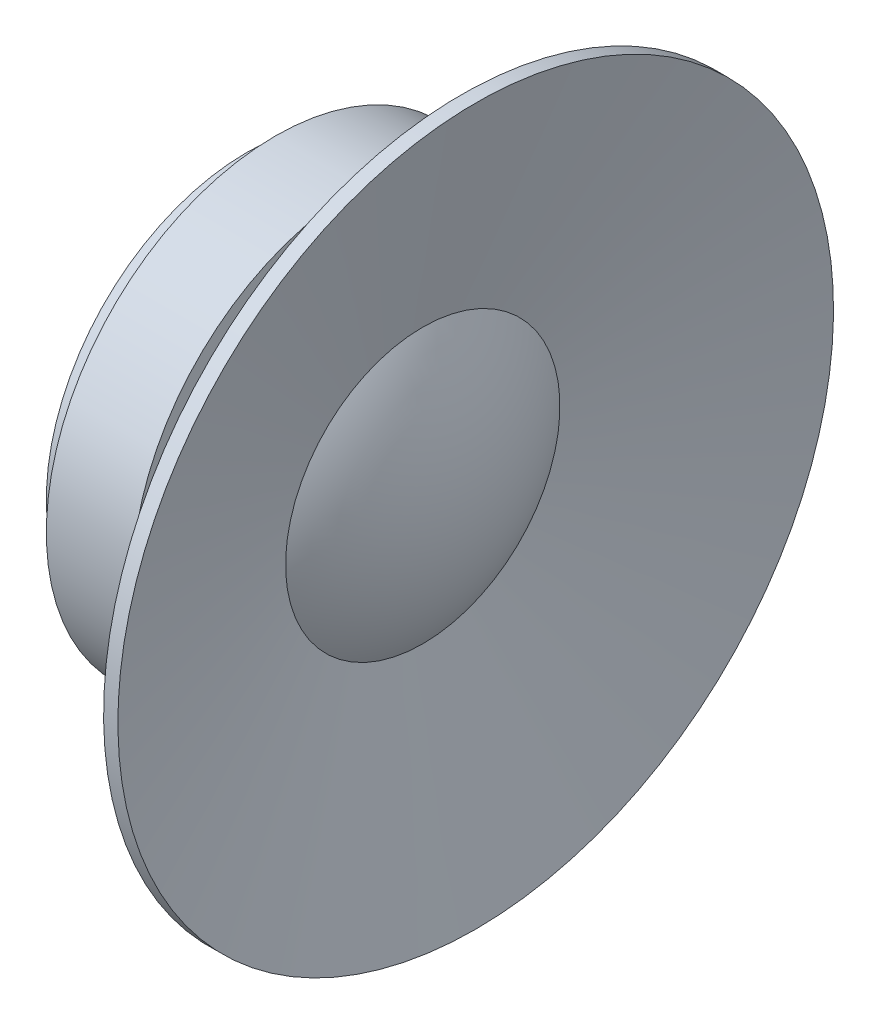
ISO-10303-21;
HEADER;
FILE_DESCRIPTION(('STEP AP214'),'2;1');
FILE_NAME('part.step','',(''),(''),'','','');
FILE_SCHEMA(('AUTOMOTIVE_DESIGN { 1 0 10303 214 1 1 1 1 }'));
ENDSEC;
DATA;
#1=APPLICATION_CONTEXT('core data for automotive mechanical design processes');
#2=APPLICATION_PROTOCOL_DEFINITION('international standard','automotive_design',2000,#1);
#3=PRODUCT_CONTEXT('',#1,'mechanical');
#4=PRODUCT('Part','Part','',(#3));
#5=PRODUCT_RELATED_PRODUCT_CATEGORY('part','',(#4));
#6=PRODUCT_DEFINITION_FORMATION('','',#4);
#7=PRODUCT_DEFINITION_CONTEXT('part definition',#1,'design');
#8=PRODUCT_DEFINITION('design','',#6,#7);
#9=PRODUCT_DEFINITION_SHAPE('','',#8);
#10=(LENGTH_UNIT() NAMED_UNIT(*) SI_UNIT(.MILLI.,.METRE.));
#11=(NAMED_UNIT(*) PLANE_ANGLE_UNIT() SI_UNIT($,.RADIAN.));
#12=(NAMED_UNIT(*) SI_UNIT($,.STERADIAN.) SOLID_ANGLE_UNIT());
#13=UNCERTAINTY_MEASURE_WITH_UNIT(LENGTH_MEASURE(1.E-05),#10,'distance_accuracy_value','');
#14=(GEOMETRIC_REPRESENTATION_CONTEXT(3) GLOBAL_UNCERTAINTY_ASSIGNED_CONTEXT((#13)) GLOBAL_UNIT_ASSIGNED_CONTEXT((#10,
#11,#12)) REPRESENTATION_CONTEXT('',''));
#15=CARTESIAN_POINT('',(0.,0.,0.));
#16=DIRECTION('',(0.,0.,1.));
#17=DIRECTION('',(1.,0.,0.));
#18=AXIS2_PLACEMENT_3D('',#15,#16,#17);
#19=CARTESIAN_POINT('',(-18.974123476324,0.,0.));
#20=DIRECTION('',(-1.,0.,0.));
#21=DIRECTION('',(0.,-1.,0.));
#22=AXIS2_PLACEMENT_3D('',#19,#20,#21);
#23=SPHERICAL_SURFACE('',#22,18.0316223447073);
#24=CARTESIAN_POINT('',(-3.69999747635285,0.,0.));
#25=DIRECTION('',(-1.,0.,0.));
#26=DIRECTION('',(0.,-1.,0.));
#27=AXIS2_PLACEMENT_3D('',#24,#25,#26);
#28=CIRCLE('',#27,9.58334384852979);
#29=CARTESIAN_POINT('',(-3.69999747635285,-9.5833438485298,0.));
#30=VERTEX_POINT('',#29);
#31=EDGE_CURVE('E10',#30,#30,#28,.T.);
#32=ORIENTED_EDGE('',*,*,#31,.F.);
#33=EDGE_LOOP('',(#32));
#34=FACE_BOUND('',#33,.T.);
#35=ADVANCED_FACE('F33',(#34),#23,.T.);
#36=CARTESIAN_POINT('',(-3.69999747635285,0.,0.));
#37=DIRECTION('',(1.,0.,0.));
#38=DIRECTION('',(0.,1.,0.));
#39=AXIS2_PLACEMENT_3D('',#36,#37,#38);
#40=CONICAL_SURFACE('',#39,9.58334384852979,1.33525134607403);
#41=CARTESIAN_POINT('',(0.,0.,0.));
#42=DIRECTION('',(-1.,0.,0.));
#43=DIRECTION('',(0.,-1.,0.));
#44=AXIS2_PLACEMENT_3D('',#41,#42,#43);
#45=CIRCLE('',#44,25.);
#46=CARTESIAN_POINT('',(0.,-25.,0.));
#47=VERTEX_POINT('',#46);
#48=EDGE_CURVE('E39',#47,#47,#45,.T.);
#49=ORIENTED_EDGE('',*,*,#48,.F.);
#50=EDGE_LOOP('',(#49));
#51=FACE_BOUND('',#50,.T.);
#52=ORIENTED_EDGE('',*,*,#31,.T.);
#53=EDGE_LOOP('',(#52));
#54=FACE_BOUND('',#53,.T.);
#55=ADVANCED_FACE('F108',(#51,#54),#40,.F.);
#56=CARTESIAN_POINT('',(-16.,0.,0.));
#57=DIRECTION('',(-1.,0.,0.));
#58=DIRECTION('',(0.,-1.,0.));
#59=AXIS2_PLACEMENT_3D('',#56,#57,#58);
#60=CYLINDRICAL_SURFACE('',#59,25.);
#61=CARTESIAN_POINT('',(-1.,0.,0.));
#62=DIRECTION('',(-1.,0.,0.));
#63=DIRECTION('',(0.,-1.,0.));
#64=AXIS2_PLACEMENT_3D('',#61,#62,#63);
#65=CIRCLE('',#64,25.);
#66=CARTESIAN_POINT('',(-1.,-25.,0.));
#67=VERTEX_POINT('',#66);
#68=EDGE_CURVE('E43',#67,#67,#65,.T.);
#69=ORIENTED_EDGE('',*,*,#68,.F.);
#70=EDGE_LOOP('',(#69));
#71=FACE_BOUND('',#70,.T.);
#72=ORIENTED_EDGE('',*,*,#48,.T.);
#73=EDGE_LOOP('',(#72));
#74=FACE_BOUND('',#73,.T.);
#75=ADVANCED_FACE('F103',(#71,#74),#60,.T.);
#76=CARTESIAN_POINT('',(-1.,0.,0.));
#77=DIRECTION('',(1.,0.,0.));
#78=DIRECTION('',(0.,1.,0.));
#79=AXIS2_PLACEMENT_3D('',#76,#77,#78);
#80=CONICAL_SURFACE('',#79,25.,1.1263771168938);
#81=CARTESIAN_POINT('',(-6.,0.,0.));
#82=DIRECTION('',(-1.,0.,0.));
#83=DIRECTION('',(0.,-1.,0.));
#84=AXIS2_PLACEMENT_3D('',#81,#82,#83);
#85=CIRCLE('',#84,14.5);
#86=CARTESIAN_POINT('',(-6.,-14.5,0.));
#87=VERTEX_POINT('',#86);
#88=EDGE_CURVE('E47',#87,#87,#85,.T.);
#89=ORIENTED_EDGE('',*,*,#88,.F.);
#90=EDGE_LOOP('',(#89));
#91=FACE_BOUND('',#90,.T.);
#92=ORIENTED_EDGE('',*,*,#68,.T.);
#93=EDGE_LOOP('',(#92));
#94=FACE_BOUND('',#93,.T.);
#95=ADVANCED_FACE('F97',(#91,#94),#80,.T.);
#96=CARTESIAN_POINT('',(-16.,0.,0.));
#97=DIRECTION('',(-1.,0.,0.));
#98=DIRECTION('',(0.,-1.,0.));
#99=AXIS2_PLACEMENT_3D('',#96,#97,#98);
#100=CYLINDRICAL_SURFACE('',#99,14.5);
#101=CARTESIAN_POINT('',(-8.,0.,0.));
#102=DIRECTION('',(-1.,0.,0.));
#103=DIRECTION('',(0.,-1.,0.));
#104=AXIS2_PLACEMENT_3D('',#101,#102,#103);
#105=CIRCLE('',#104,14.5);
#106=CARTESIAN_POINT('',(-8.,-14.5,0.));
#107=VERTEX_POINT('',#106);
#108=EDGE_CURVE('E52',#107,#107,#105,.T.);
#109=ORIENTED_EDGE('',*,*,#108,.F.);
#110=EDGE_LOOP('',(#109));
#111=FACE_BOUND('',#110,.T.);
#112=ORIENTED_EDGE('',*,*,#88,.T.);
#113=EDGE_LOOP('',(#112));
#114=FACE_BOUND('',#113,.T.);
#115=ADVANCED_FACE('F91',(#111,#114),#100,.T.);
#116=CARTESIAN_POINT('',(-8.,14.5,0.));
#117=DIRECTION('',(-1.,0.,0.));
#118=DIRECTION('',(0.,-1.,0.));
#119=AXIS2_PLACEMENT_3D('',#116,#117,#118);
#120=PLANE('',#119);
#121=CARTESIAN_POINT('',(-8.,0.,0.));
#122=DIRECTION('',(-1.,0.,0.));
#123=DIRECTION('',(0.,-1.,0.));
#124=AXIS2_PLACEMENT_3D('',#121,#122,#123);
#125=CIRCLE('',#124,16.);
#126=CARTESIAN_POINT('',(-8.,-16.,0.));
#127=VERTEX_POINT('',#126);
#128=EDGE_CURVE('E55',#127,#127,#125,.T.);
#129=ORIENTED_EDGE('',*,*,#128,.F.);
#130=EDGE_LOOP('',(#129));
#131=FACE_BOUND('',#130,.T.);
#132=ORIENTED_EDGE('',*,*,#108,.T.);
#133=EDGE_LOOP('',(#132));
#134=FACE_BOUND('',#133,.T.);
#135=ADVANCED_FACE('F85',(#131,#134),#120,.F.);
#136=CARTESIAN_POINT('',(-16.,0.,0.));
#137=DIRECTION('',(-1.,0.,0.));
#138=DIRECTION('',(0.,-1.,0.));
#139=AXIS2_PLACEMENT_3D('',#136,#137,#138);
#140=CYLINDRICAL_SURFACE('',#139,16.);
#141=CARTESIAN_POINT('',(-14.,0.,0.));
#142=DIRECTION('',(-1.,0.,0.));
#143=DIRECTION('',(0.,-1.,0.));
#144=AXIS2_PLACEMENT_3D('',#141,#142,#143);
#145=CIRCLE('',#144,16.);
#146=CARTESIAN_POINT('',(-14.,-16.,0.));
#147=VERTEX_POINT('',#146);
#148=EDGE_CURVE('E58',#147,#147,#145,.T.);
#149=ORIENTED_EDGE('',*,*,#148,.F.);
#150=EDGE_LOOP('',(#149));
#151=FACE_BOUND('',#150,.T.);
#152=ORIENTED_EDGE('',*,*,#128,.T.);
#153=EDGE_LOOP('',(#152));
#154=FACE_BOUND('',#153,.T.);
#155=ADVANCED_FACE('F79',(#151,#154),#140,.T.);
#156=CARTESIAN_POINT('',(-14.,16.,0.));
#157=DIRECTION('',(1.,0.,0.));
#158=DIRECTION('',(0.,1.,0.));
#159=AXIS2_PLACEMENT_3D('',#156,#157,#158);
#160=PLANE('',#159);
#161=CARTESIAN_POINT('',(-14.,0.,0.));
#162=DIRECTION('',(-1.,0.,0.));
#163=DIRECTION('',(0.,-1.,0.));
#164=AXIS2_PLACEMENT_3D('',#161,#162,#163);
#165=CIRCLE('',#164,14.);
#166=CARTESIAN_POINT('',(-14.,-14.,0.));
#167=VERTEX_POINT('',#166);
#168=EDGE_CURVE('E61',#167,#167,#165,.T.);
#169=ORIENTED_EDGE('',*,*,#168,.F.);
#170=EDGE_LOOP('',(#169));
#171=FACE_BOUND('',#170,.T.);
#172=ORIENTED_EDGE('',*,*,#148,.T.);
#173=EDGE_LOOP('',(#172));
#174=FACE_BOUND('',#173,.T.);
#175=ADVANCED_FACE('F73',(#171,#174),#160,.F.);
#176=CARTESIAN_POINT('',(-16.,0.,0.));
#177=DIRECTION('',(-1.,0.,0.));
#178=DIRECTION('',(0.,-1.,0.));
#179=AXIS2_PLACEMENT_3D('',#176,#177,#178);
#180=CYLINDRICAL_SURFACE('',#179,14.);
#181=CARTESIAN_POINT('',(-16.,0.,0.));
#182=DIRECTION('',(-1.,0.,0.));
#183=DIRECTION('',(0.,-1.,0.));
#184=AXIS2_PLACEMENT_3D('',#181,#182,#183);
#185=CIRCLE('',#184,14.);
#186=CARTESIAN_POINT('',(-16.,-14.,0.));
#187=VERTEX_POINT('',#186);
#188=EDGE_CURVE('E64',#187,#187,#185,.T.);
#189=ORIENTED_EDGE('',*,*,#188,.F.);
#190=EDGE_LOOP('',(#189));
#191=FACE_BOUND('',#190,.T.);
#192=ORIENTED_EDGE('',*,*,#168,.T.);
#193=EDGE_LOOP('',(#192));
#194=FACE_BOUND('',#193,.T.);
#195=ADVANCED_FACE('F70',(#191,#194),#180,.T.);
#196=CARTESIAN_POINT('',(-16.,14.,0.));
#197=DIRECTION('',(1.,0.,0.));
#198=DIRECTION('',(0.,1.,0.));
#199=AXIS2_PLACEMENT_3D('',#196,#197,#198);
#200=PLANE('',#199);
#201=ORIENTED_EDGE('',*,*,#188,.T.);
#202=EDGE_LOOP('',(#201));
#203=FACE_BOUND('',#202,.T.);
#204=ADVANCED_FACE('F68',(#203),#200,.F.);
#205=CLOSED_SHELL('',(#35,#55,#75,#95,#115,#135,#155,#175,#195,#204));
#206=MANIFOLD_SOLID_BREP('B2',#205);
#207=ADVANCED_BREP_SHAPE_REPRESENTATION('',(#18,#206),#14);
#208=SHAPE_DEFINITION_REPRESENTATION(#9,#207);
ENDSEC;
END-ISO-10303-21;
